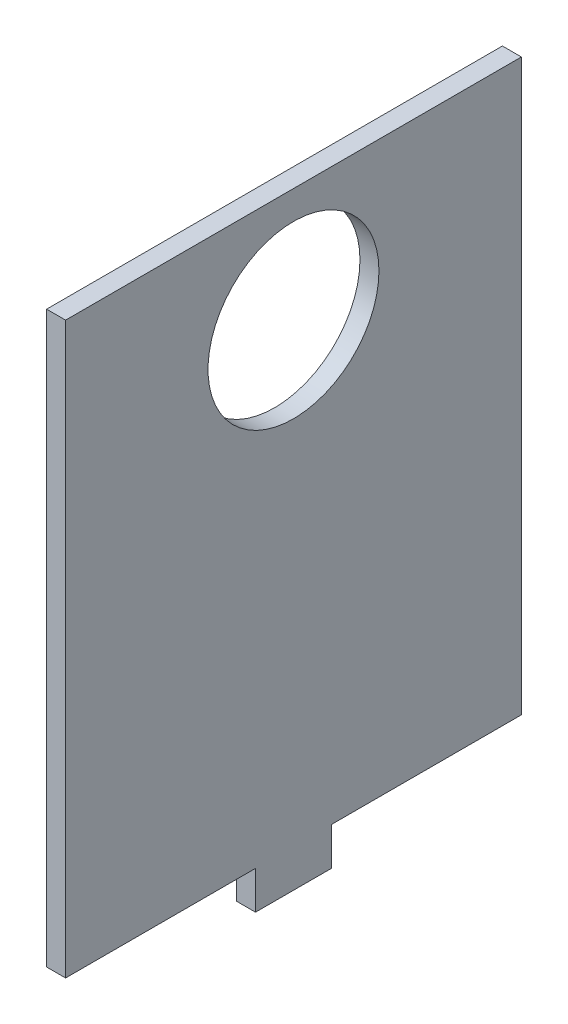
from build123d import *

# Parameters (mm, degrees)
SKETCH1_W           = 152.4
SKETCH1_H           = 203.2
BOSS_EXTRUDE1_DEPTH = 6.35
SKETCH2_W           = 63.5
SKETCH2_H           = 12.7
CUT_EXTRUDE1_DEPTH  = 6.35
SKETCH3_R           = 28.575
CUT_EXTRUDE2_DEPTH  = 6.35


with BuildPart() as part:
    # Sketch1 → Boss-Extrude1 (new body)
    with BuildSketch(Plane(origin=(0, 0, 0), x_dir=(0, 0, -1), z_dir=(1, 0, 0))):
        with Locations((76.2, 101.6)):
            Rectangle(SKETCH1_W, SKETCH1_H)
    extrude(amount=BOSS_EXTRUDE1_DEPTH)

    # Sketch2 → Cut-Extrude1 (cut)
    with BuildSketch(Plane(origin=(6.35, 0, 0), x_dir=(0, 0, -1), z_dir=(1, 0, 0))):
        with Locations((31.75, 6.35)):
            Rectangle(SKETCH2_W, SKETCH2_H)
        with Locations((120.65, 6.35)):
            Rectangle(SKETCH2_W, SKETCH2_H)
    extrude(amount=-CUT_EXTRUDE1_DEPTH, mode=Mode.SUBTRACT)

    # Sketch3 → Cut-Extrude2 (cut)
    with BuildSketch(Plane(origin=(6.35, 0, 0), x_dir=(0, 0, -1), z_dir=(1, 0, 0))):
        with Locations((76.2, 165.1)):
            Circle(SKETCH3_R)
    extrude(amount=-CUT_EXTRUDE2_DEPTH, mode=Mode.SUBTRACT)


solid = part.part
